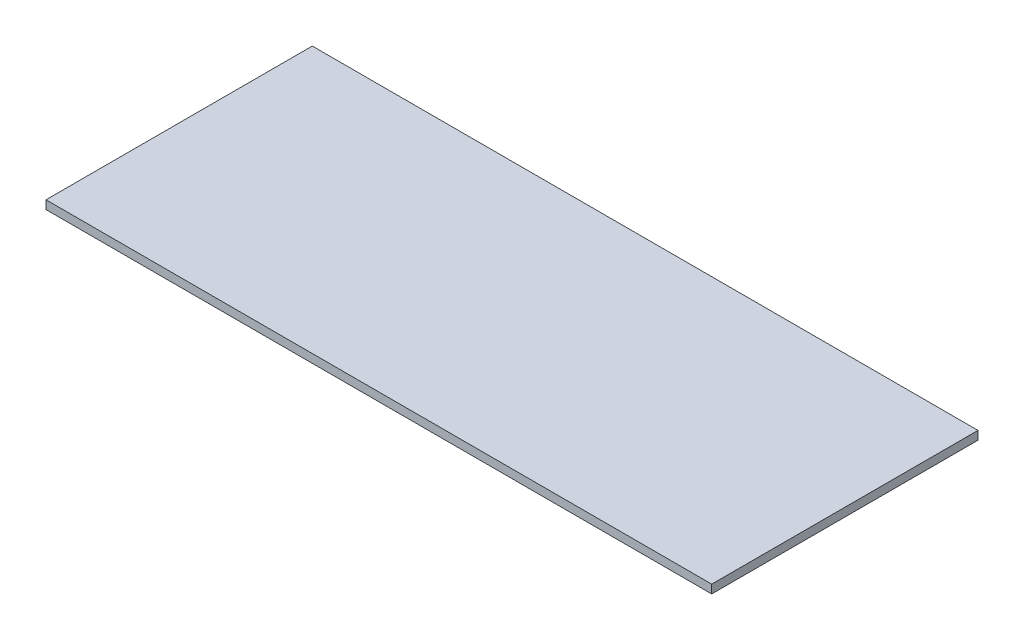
ISO-10303-21;
HEADER;
FILE_DESCRIPTION(('STEP AP214'),'2;1');
FILE_NAME('part.step','',(''),(''),'','','');
FILE_SCHEMA(('AUTOMOTIVE_DESIGN { 1 0 10303 214 1 1 1 1 }'));
ENDSEC;
DATA;
#1=APPLICATION_CONTEXT('core data for automotive mechanical design processes');
#2=APPLICATION_PROTOCOL_DEFINITION('international standard','automotive_design',2000,#1);
#3=PRODUCT_CONTEXT('',#1,'mechanical');
#4=PRODUCT('Part','Part','',(#3));
#5=PRODUCT_RELATED_PRODUCT_CATEGORY('part','',(#4));
#6=PRODUCT_DEFINITION_FORMATION('','',#4);
#7=PRODUCT_DEFINITION_CONTEXT('part definition',#1,'design');
#8=PRODUCT_DEFINITION('design','',#6,#7);
#9=PRODUCT_DEFINITION_SHAPE('','',#8);
#10=(LENGTH_UNIT() NAMED_UNIT(*) SI_UNIT(.MILLI.,.METRE.));
#11=(NAMED_UNIT(*) PLANE_ANGLE_UNIT() SI_UNIT($,.RADIAN.));
#12=(NAMED_UNIT(*) SI_UNIT($,.STERADIAN.) SOLID_ANGLE_UNIT());
#13=UNCERTAINTY_MEASURE_WITH_UNIT(LENGTH_MEASURE(1.E-05),#10,'distance_accuracy_value','');
#14=(GEOMETRIC_REPRESENTATION_CONTEXT(3) GLOBAL_UNCERTAINTY_ASSIGNED_CONTEXT((#13)) GLOBAL_UNIT_ASSIGNED_CONTEXT((#10,
#11,#12)) REPRESENTATION_CONTEXT('',''));
#15=CARTESIAN_POINT('',(0.,0.,0.));
#16=DIRECTION('',(0.,0.,1.));
#17=DIRECTION('',(1.,0.,0.));
#18=AXIS2_PLACEMENT_3D('',#15,#16,#17);
#19=CARTESIAN_POINT('',(0.,0.8128,0.));
#20=DIRECTION('',(1.,0.,0.));
#21=DIRECTION('',(0.,0.,-1.));
#22=AXIS2_PLACEMENT_3D('',#19,#20,#21);
#23=PLANE('',#22);
#24=DIRECTION('',(0.,0.,1.));
#25=VECTOR('',#24,1.);
#26=CARTESIAN_POINT('',(0.,0.,0.));
#27=LINE('',#26,#25);
#28=CARTESIAN_POINT('',(0.,0.,-25.4));
#29=VERTEX_POINT('',#28);
#30=CARTESIAN_POINT('',(0.,0.,0.));
#31=VERTEX_POINT('',#30);
#32=EDGE_CURVE('E97',#29,#31,#27,.T.);
#33=ORIENTED_EDGE('',*,*,#32,.T.);
#34=DIRECTION('',(0.,-1.,0.));
#35=VECTOR('',#34,1.);
#36=CARTESIAN_POINT('',(0.,0.8128,0.));
#37=LINE('',#36,#35);
#38=CARTESIAN_POINT('',(0.,0.8128,0.));
#39=VERTEX_POINT('',#38);
#40=EDGE_CURVE('E11',#39,#31,#37,.T.);
#41=ORIENTED_EDGE('',*,*,#40,.F.);
#42=DIRECTION('',(0.,0.,1.));
#43=VECTOR('',#42,1.);
#44=CARTESIAN_POINT('',(0.,0.8128,0.));
#45=LINE('',#44,#43);
#46=CARTESIAN_POINT('',(0.,0.8128,-25.4));
#47=VERTEX_POINT('',#46);
#48=EDGE_CURVE('E85',#47,#39,#45,.T.);
#49=ORIENTED_EDGE('',*,*,#48,.F.);
#50=DIRECTION('',(0.,-1.,0.));
#51=VECTOR('',#50,1.);
#52=CARTESIAN_POINT('',(0.,0.8128,-25.4));
#53=LINE('',#52,#51);
#54=EDGE_CURVE('E93',#47,#29,#53,.T.);
#55=ORIENTED_EDGE('',*,*,#54,.T.);
#56=EDGE_LOOP('',(#33,#41,#49,#55));
#57=FACE_BOUND('',#56,.T.);
#58=ADVANCED_FACE('F34',(#57),#23,.F.);
#59=CARTESIAN_POINT('',(0.,0.8128,0.));
#60=DIRECTION('',(0.,0.,-1.));
#61=DIRECTION('',(-1.,0.,0.));
#62=AXIS2_PLACEMENT_3D('',#59,#60,#61);
#63=PLANE('',#62);
#64=DIRECTION('',(1.,0.,0.));
#65=VECTOR('',#64,1.);
#66=CARTESIAN_POINT('',(0.,0.,0.));
#67=LINE('',#66,#65);
#68=CARTESIAN_POINT('',(63.5,0.,0.));
#69=VERTEX_POINT('',#68);
#70=EDGE_CURVE('E89',#31,#69,#67,.T.);
#71=ORIENTED_EDGE('',*,*,#70,.T.);
#72=DIRECTION('',(0.,-1.,0.));
#73=VECTOR('',#72,1.);
#74=CARTESIAN_POINT('',(63.5,0.8128,0.));
#75=LINE('',#74,#73);
#76=CARTESIAN_POINT('',(63.5,0.8128,0.));
#77=VERTEX_POINT('',#76);
#78=EDGE_CURVE('E42',#77,#69,#75,.T.);
#79=ORIENTED_EDGE('',*,*,#78,.F.);
#80=DIRECTION('',(1.,0.,0.));
#81=VECTOR('',#80,1.);
#82=CARTESIAN_POINT('',(0.,0.8128,0.));
#83=LINE('',#82,#81);
#84=EDGE_CURVE('E80',#39,#77,#83,.T.);
#85=ORIENTED_EDGE('',*,*,#84,.F.);
#86=ORIENTED_EDGE('',*,*,#40,.T.);
#87=EDGE_LOOP('',(#71,#79,#85,#86));
#88=FACE_BOUND('',#87,.T.);
#89=ADVANCED_FACE('F88',(#88),#63,.F.);
#90=CARTESIAN_POINT('',(63.5,0.8128,0.));
#91=DIRECTION('',(-1.,0.,0.));
#92=DIRECTION('',(0.,0.,1.));
#93=AXIS2_PLACEMENT_3D('',#90,#91,#92);
#94=PLANE('',#93);
#95=DIRECTION('',(0.,0.,-1.));
#96=VECTOR('',#95,1.);
#97=CARTESIAN_POINT('',(63.5,0.,0.));
#98=LINE('',#97,#96);
#99=CARTESIAN_POINT('',(63.5,0.,-25.4));
#100=VERTEX_POINT('',#99);
#101=EDGE_CURVE('E67',#69,#100,#98,.T.);
#102=ORIENTED_EDGE('',*,*,#101,.T.);
#103=DIRECTION('',(0.,-1.,0.));
#104=VECTOR('',#103,1.);
#105=CARTESIAN_POINT('',(63.5,0.8128,-25.4));
#106=LINE('',#105,#104);
#107=CARTESIAN_POINT('',(63.5,0.8128,-25.4));
#108=VERTEX_POINT('',#107);
#109=EDGE_CURVE('E90',#108,#100,#106,.T.);
#110=ORIENTED_EDGE('',*,*,#109,.F.);
#111=DIRECTION('',(0.,0.,-1.));
#112=VECTOR('',#111,1.);
#113=CARTESIAN_POINT('',(63.5,0.8128,0.));
#114=LINE('',#113,#112);
#115=EDGE_CURVE('E83',#77,#108,#114,.T.);
#116=ORIENTED_EDGE('',*,*,#115,.F.);
#117=ORIENTED_EDGE('',*,*,#78,.T.);
#118=EDGE_LOOP('',(#102,#110,#116,#117));
#119=FACE_BOUND('',#118,.T.);
#120=ADVANCED_FACE('F91',(#119),#94,.F.);
#121=CARTESIAN_POINT('',(0.,0.8128,-25.4));
#122=DIRECTION('',(0.,0.,1.));
#123=DIRECTION('',(1.,0.,0.));
#124=AXIS2_PLACEMENT_3D('',#121,#122,#123);
#125=PLANE('',#124);
#126=DIRECTION('',(-1.,0.,0.));
#127=VECTOR('',#126,1.);
#128=CARTESIAN_POINT('',(0.,0.,-25.4));
#129=LINE('',#128,#127);
#130=EDGE_CURVE('E73',#100,#29,#129,.T.);
#131=ORIENTED_EDGE('',*,*,#130,.T.);
#132=ORIENTED_EDGE('',*,*,#54,.F.);
#133=DIRECTION('',(-1.,0.,0.));
#134=VECTOR('',#133,1.);
#135=CARTESIAN_POINT('',(0.,0.8128,-25.4));
#136=LINE('',#135,#134);
#137=EDGE_CURVE('E50',#108,#47,#136,.T.);
#138=ORIENTED_EDGE('',*,*,#137,.F.);
#139=ORIENTED_EDGE('',*,*,#109,.T.);
#140=EDGE_LOOP('',(#131,#132,#138,#139));
#141=FACE_BOUND('',#140,.T.);
#142=ADVANCED_FACE('F104',(#141),#125,.F.);
#143=CARTESIAN_POINT('',(0.,0.8128,0.));
#144=DIRECTION('',(0.,-1.,0.));
#145=DIRECTION('',(0.,0.,-1.));
#146=AXIS2_PLACEMENT_3D('',#143,#144,#145);
#147=PLANE('',#146);
#148=ORIENTED_EDGE('',*,*,#48,.T.);
#149=ORIENTED_EDGE('',*,*,#84,.T.);
#150=ORIENTED_EDGE('',*,*,#115,.T.);
#151=ORIENTED_EDGE('',*,*,#137,.T.);
#152=EDGE_LOOP('',(#148,#149,#150,#151));
#153=FACE_BOUND('',#152,.T.);
#154=ADVANCED_FACE('F81',(#153),#147,.F.);
#155=CARTESIAN_POINT('',(0.,0.,0.));
#156=DIRECTION('',(0.,-1.,0.));
#157=DIRECTION('',(0.,0.,-1.));
#158=AXIS2_PLACEMENT_3D('',#155,#156,#157);
#159=PLANE('',#158);
#160=ORIENTED_EDGE('',*,*,#32,.F.);
#161=ORIENTED_EDGE('',*,*,#130,.F.);
#162=ORIENTED_EDGE('',*,*,#101,.F.);
#163=ORIENTED_EDGE('',*,*,#70,.F.);
#164=EDGE_LOOP('',(#160,#161,#162,#163));
#165=FACE_BOUND('',#164,.T.);
#166=ADVANCED_FACE('F107',(#165),#159,.T.);
#167=CLOSED_SHELL('',(#58,#89,#120,#142,#154,#166));
#168=MANIFOLD_SOLID_BREP('B2',#167);
#169=ADVANCED_BREP_SHAPE_REPRESENTATION('',(#18,#168),#14);
#170=SHAPE_DEFINITION_REPRESENTATION(#9,#169);
ENDSEC;
END-ISO-10303-21;
